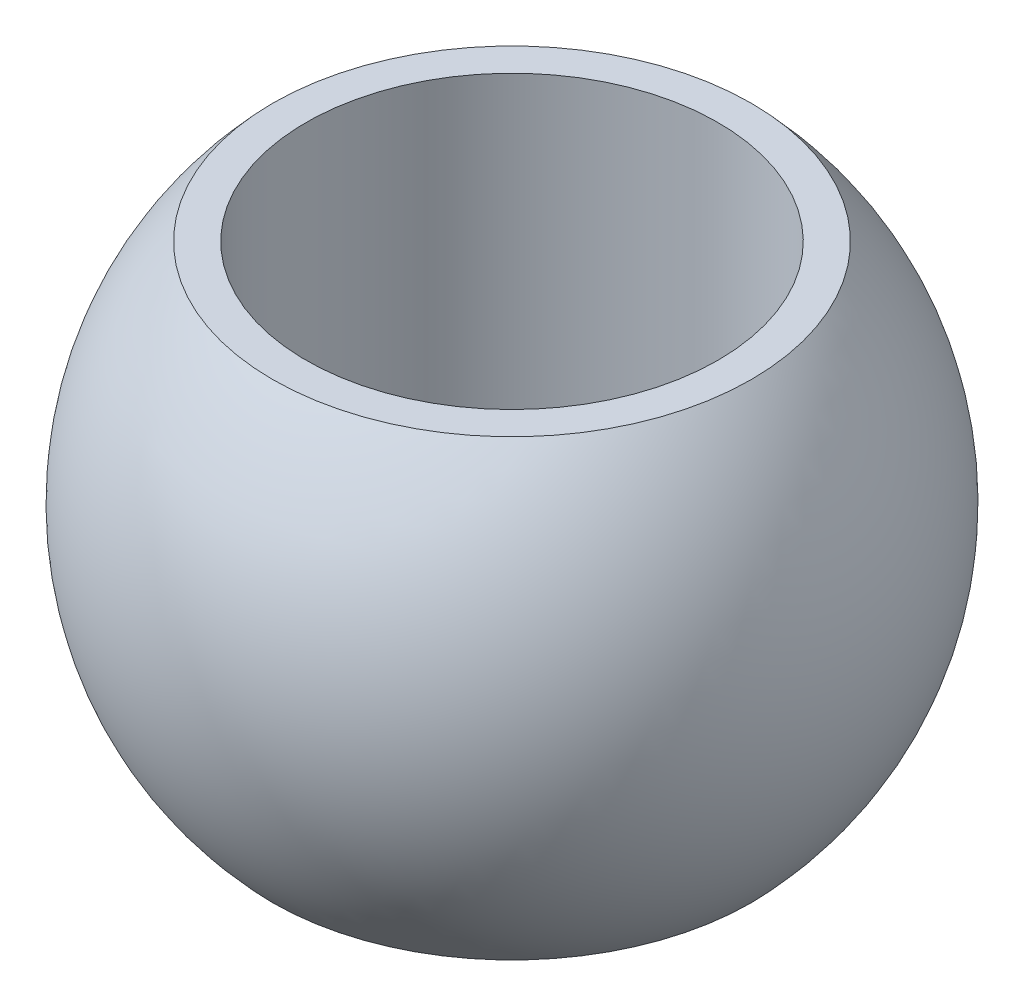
ISO-10303-21;
HEADER;
FILE_DESCRIPTION(('STEP AP214'),'2;1');
FILE_NAME('part.step','',(''),(''),'','','');
FILE_SCHEMA(('AUTOMOTIVE_DESIGN { 1 0 10303 214 1 1 1 1 }'));
ENDSEC;
DATA;
#1=APPLICATION_CONTEXT('core data for automotive mechanical design processes');
#2=APPLICATION_PROTOCOL_DEFINITION('international standard','automotive_design',2000,#1);
#3=PRODUCT_CONTEXT('',#1,'mechanical');
#4=PRODUCT('Part','Part','',(#3));
#5=PRODUCT_RELATED_PRODUCT_CATEGORY('part','',(#4));
#6=PRODUCT_DEFINITION_FORMATION('','',#4);
#7=PRODUCT_DEFINITION_CONTEXT('part definition',#1,'design');
#8=PRODUCT_DEFINITION('design','',#6,#7);
#9=PRODUCT_DEFINITION_SHAPE('','',#8);
#10=(LENGTH_UNIT() NAMED_UNIT(*) SI_UNIT(.MILLI.,.METRE.));
#11=(NAMED_UNIT(*) PLANE_ANGLE_UNIT() SI_UNIT($,.RADIAN.));
#12=(NAMED_UNIT(*) SI_UNIT($,.STERADIAN.) SOLID_ANGLE_UNIT());
#13=UNCERTAINTY_MEASURE_WITH_UNIT(LENGTH_MEASURE(1.E-05),#10,'distance_accuracy_value','');
#14=(GEOMETRIC_REPRESENTATION_CONTEXT(3) GLOBAL_UNCERTAINTY_ASSIGNED_CONTEXT((#13)) GLOBAL_UNIT_ASSIGNED_CONTEXT((#10,
#11,#12)) REPRESENTATION_CONTEXT('',''));
#15=CARTESIAN_POINT('',(0.,0.,0.));
#16=DIRECTION('',(0.,0.,1.));
#17=DIRECTION('',(1.,0.,0.));
#18=AXIS2_PLACEMENT_3D('',#15,#16,#17);
#19=CARTESIAN_POINT('',(-25.,27.5,0.));
#20=DIRECTION('',(0.,-1.,0.));
#21=DIRECTION('',(1.,0.,0.));
#22=AXIS2_PLACEMENT_3D('',#19,#20,#21);
#23=PLANE('',#22);
#24=CARTESIAN_POINT('',(0.,27.5,0.));
#25=DIRECTION('',(0.,-1.,0.));
#26=DIRECTION('',(1.,0.,0.));
#27=AXIS2_PLACEMENT_3D('',#24,#25,#26);
#28=CIRCLE('',#27,29.0473750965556);
#29=CARTESIAN_POINT('',(-29.0473750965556,27.5,0.));
#30=VERTEX_POINT('',#29);
#31=EDGE_CURVE('E10',#30,#30,#28,.T.);
#32=ORIENTED_EDGE('',*,*,#31,.F.);
#33=EDGE_LOOP('',(#32));
#34=FACE_BOUND('',#33,.T.);
#35=CARTESIAN_POINT('',(0.,27.5,0.));
#36=DIRECTION('',(0.,-1.,0.));
#37=DIRECTION('',(1.,0.,0.));
#38=AXIS2_PLACEMENT_3D('',#35,#36,#37);
#39=CIRCLE('',#38,25.);
#40=CARTESIAN_POINT('',(25.,27.5,0.));
#41=VERTEX_POINT('',#40);
#42=EDGE_CURVE('E49',#41,#41,#39,.T.);
#43=ORIENTED_EDGE('',*,*,#42,.T.);
#44=EDGE_LOOP('',(#43));
#45=FACE_BOUND('',#44,.T.);
#46=ADVANCED_FACE('F35',(#34,#45),#23,.F.);
#47=CARTESIAN_POINT('',(0.,0.,0.));
#48=DIRECTION('',(0.,-1.,0.));
#49=DIRECTION('',(-1.,0.,0.));
#50=AXIS2_PLACEMENT_3D('',#47,#48,#49);
#51=SPHERICAL_SURFACE('',#50,40.);
#52=CARTESIAN_POINT('',(0.,-27.5,0.));
#53=DIRECTION('',(0.,-1.,0.));
#54=DIRECTION('',(1.,0.,0.));
#55=AXIS2_PLACEMENT_3D('',#52,#53,#54);
#56=CIRCLE('',#55,29.0473750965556);
#57=CARTESIAN_POINT('',(-29.0473750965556,-27.5,0.));
#58=VERTEX_POINT('',#57);
#59=EDGE_CURVE('E41',#58,#58,#56,.T.);
#60=CARTESIAN_POINT('',(-29.0473750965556,-27.5,0.));
#61=CARTESIAN_POINT('',(-29.4816784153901,-27.0412767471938,0.));
#62=CARTESIAN_POINT('',(-29.9050970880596,-26.5722500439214,0.));
#63=CARTESIAN_POINT('',(-30.7292550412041,-25.6146768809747,0.));
#64=CARTESIAN_POINT('',(-31.1299943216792,-25.1261304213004,0.));
#65=CARTESIAN_POINT('',(-31.9078833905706,-24.1306048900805,0.));
#66=CARTESIAN_POINT('',(-32.2850331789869,-23.6236258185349,0.));
#67=CARTESIAN_POINT('',(-33.0148997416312,-22.5923753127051,0.));
#68=CARTESIAN_POINT('',(-33.3676165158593,-22.068103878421,0.));
#69=CARTESIAN_POINT('',(-34.0478247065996,-21.0034445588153,0.));
#70=CARTESIAN_POINT('',(-34.3753161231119,-20.4630566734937,0.));
#71=CARTESIAN_POINT('',(-35.0043388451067,-19.3673773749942,0.));
#72=CARTESIAN_POINT('',(-35.3058701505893,-18.8120859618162,0.));
#73=CARTESIAN_POINT('',(-35.8822958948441,-17.6878457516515,0.));
#74=CARTESIAN_POINT('',(-36.1571903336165,-17.1188969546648,0.));
#75=CARTESIAN_POINT('',(-36.6797254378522,-15.9686188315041,0.));
#76=CARTESIAN_POINT('',(-36.9273661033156,-15.3872895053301,0.));
#77=CARTESIAN_POINT('',(-37.3948378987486,-14.2135549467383,0.));
#78=CARTESIAN_POINT('',(-37.6146690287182,-13.6211497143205,0.));
#79=CARTESIAN_POINT('',(-38.0260284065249,-12.4265928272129,0.));
#80=CARTESIAN_POINT('',(-38.2175566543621,-11.8244411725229,0.));
#81=CARTESIAN_POINT('',(-38.5718804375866,-10.6117427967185,0.));
#82=CARTESIAN_POINT('',(-38.734675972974,-10.0011960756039,0.));
#83=CARTESIAN_POINT('',(-39.0311689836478,-8.77307776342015,0.));
#84=CARTESIAN_POINT('',(-39.1648664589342,-8.15550617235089,0.));
#85=CARTESIAN_POINT('',(-39.4028633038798,-6.91472408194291,0.));
#86=CARTESIAN_POINT('',(-39.5071626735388,-6.29151358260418,0.));
#87=CARTESIAN_POINT('',(-39.6861292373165,-5.04085229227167,0.));
#88=CARTESIAN_POINT('',(-39.7607964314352,-4.41340150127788,0.));
#89=CARTESIAN_POINT('',(-39.8803310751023,-3.15566776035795,0.));
#90=CARTESIAN_POINT('',(-39.9251985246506,-2.52538481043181,0.));
#91=CARTESIAN_POINT('',(-39.9850329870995,-1.26340124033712,0.));
#92=CARTESIAN_POINT('',(-40.,-0.631700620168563,0.));
#93=CARTESIAN_POINT('',(-40.,0.63170062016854,0.));
#94=CARTESIAN_POINT('',(-39.9850329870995,1.26340124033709,0.));
#95=CARTESIAN_POINT('',(-39.9251985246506,2.52538481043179,0.));
#96=CARTESIAN_POINT('',(-39.8803310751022,3.15566776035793,0.));
#97=CARTESIAN_POINT('',(-39.7607964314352,4.41340150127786,0.));
#98=CARTESIAN_POINT('',(-39.6861292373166,5.04085229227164,0.));
#99=CARTESIAN_POINT('',(-39.5071626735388,6.29151358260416,0.));
#100=CARTESIAN_POINT('',(-39.4028633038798,6.91472408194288,0.));
#101=CARTESIAN_POINT('',(-39.1648664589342,8.15550617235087,0.));
#102=CARTESIAN_POINT('',(-39.0311689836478,8.77307776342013,0.));
#103=CARTESIAN_POINT('',(-38.734675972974,10.0011960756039,0.));
#104=CARTESIAN_POINT('',(-38.5718804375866,10.6117427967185,0.));
#105=CARTESIAN_POINT('',(-38.2175566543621,11.8244411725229,0.));
#106=CARTESIAN_POINT('',(-38.0260284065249,12.4265928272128,0.));
#107=CARTESIAN_POINT('',(-37.6146690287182,13.6211497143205,0.));
#108=CARTESIAN_POINT('',(-37.3948378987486,14.2135549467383,0.));
#109=CARTESIAN_POINT('',(-36.9273661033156,15.3872895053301,0.));
#110=CARTESIAN_POINT('',(-36.6797254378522,15.9686188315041,0.));
#111=CARTESIAN_POINT('',(-36.1571903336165,17.1188969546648,0.));
#112=CARTESIAN_POINT('',(-35.8822958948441,17.6878457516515,0.));
#113=CARTESIAN_POINT('',(-35.3058701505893,18.8120859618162,0.));
#114=CARTESIAN_POINT('',(-35.0043388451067,19.3673773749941,0.));
#115=CARTESIAN_POINT('',(-34.3753161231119,20.4630566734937,0.));
#116=CARTESIAN_POINT('',(-34.0478247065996,21.0034445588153,0.));
#117=CARTESIAN_POINT('',(-33.3676165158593,22.068103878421,0.));
#118=CARTESIAN_POINT('',(-33.0148997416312,22.5923753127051,0.));
#119=CARTESIAN_POINT('',(-32.2850331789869,23.6236258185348,0.));
#120=CARTESIAN_POINT('',(-31.9078833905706,24.1306048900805,0.));
#121=CARTESIAN_POINT('',(-31.1299943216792,25.1261304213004,0.));
#122=CARTESIAN_POINT('',(-30.7292550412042,25.6146768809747,0.));
#123=CARTESIAN_POINT('',(-29.9050970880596,26.5722500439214,0.));
#124=CARTESIAN_POINT('',(-29.4816784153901,27.0412767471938,0.));
#125=CARTESIAN_POINT('',(-29.0473750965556,27.5,0.));
#126=B_SPLINE_CURVE_WITH_KNOTS('',3,(#60,#61,#62,#63,#64,#65,#66,#67,#68,#69,#70,#71,#72,#73,
#74,#75,#76,#77,#78,#79,#80,#81,#82,#83,#84,#85,#86,#87,#88,#89,#90,#91,#92,#93,#94,#95,#96,#97,
#98,#99,#100,#101,#102,#103,#104,#105,#106,#107,#108,#109,#110,#111,#112,#113,#114,#115,#116,
#117,#118,#119,#120,#121,#122,#123,#124,#125),.UNSPECIFIED.,.F.,.F.,(4,2,2,2,2,2,2,2,2,2,2,2,2,
2,2,2,2,2,2,2,2,2,2,2,2,2,2,2,2,2,2,2,4),(0.,1.89492467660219,3.78984935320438,5.68477402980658,
7.57969870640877,9.47462338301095,11.3695480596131,13.2644727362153,15.1593974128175,
17.0543220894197,18.9492467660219,20.8441714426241,22.7390961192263,24.6340207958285,
26.5289454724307,28.4238701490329,30.3187948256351,32.2137195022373,34.1086441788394,
36.0035688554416,37.8984935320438,39.793418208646,41.6883428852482,43.5832675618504,
45.4781922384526,47.3731169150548,49.268041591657,51.1629662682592,53.0578909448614,
54.9528156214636,56.8477402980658,58.742664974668,60.6375896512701),.UNSPECIFIED.);
#127=EDGE_CURVE('BSEAM64',#58,#30,#126,.T.);
#128=ORIENTED_EDGE('',*,*,#59,.F.);
#129=ORIENTED_EDGE('',*,*,#31,.T.);
#130=ORIENTED_EDGE('',*,*,#127,.T.);
#131=ORIENTED_EDGE('',*,*,#127,.F.);
#132=EDGE_LOOP('',(#128,#130,#129,#131));
#133=FACE_BOUND('',#132,.T.);
#134=ADVANCED_FACE('F64',(#133),#51,.T.);
#135=CARTESIAN_POINT('',(-25.,-27.5,0.));
#136=DIRECTION('',(0.,1.,0.));
#137=DIRECTION('',(-1.,0.,0.));
#138=AXIS2_PLACEMENT_3D('',#135,#136,#137);
#139=PLANE('',#138);
#140=CARTESIAN_POINT('',(0.,-27.5,0.));
#141=DIRECTION('',(0.,-1.,0.));
#142=DIRECTION('',(1.,0.,0.));
#143=AXIS2_PLACEMENT_3D('',#140,#141,#142);
#144=CIRCLE('',#143,25.);
#145=CARTESIAN_POINT('',(25.,-27.5,0.));
#146=VERTEX_POINT('',#145);
#147=EDGE_CURVE('E45',#146,#146,#144,.T.);
#148=ORIENTED_EDGE('',*,*,#147,.F.);
#149=EDGE_LOOP('',(#148));
#150=FACE_BOUND('',#149,.T.);
#151=ORIENTED_EDGE('',*,*,#59,.T.);
#152=EDGE_LOOP('',(#151));
#153=FACE_BOUND('',#152,.T.);
#154=ADVANCED_FACE('F59',(#150,#153),#139,.F.);
#155=CARTESIAN_POINT('',(0.,-27.5,0.));
#156=DIRECTION('',(0.,-1.,0.));
#157=DIRECTION('',(1.,0.,0.));
#158=AXIS2_PLACEMENT_3D('',#155,#156,#157);
#159=CYLINDRICAL_SURFACE('',#158,25.);
#160=ORIENTED_EDGE('',*,*,#42,.F.);
#161=EDGE_LOOP('',(#160));
#162=FACE_BOUND('',#161,.T.);
#163=ORIENTED_EDGE('',*,*,#147,.T.);
#164=EDGE_LOOP('',(#163));
#165=FACE_BOUND('',#164,.T.);
#166=ADVANCED_FACE('F56',(#162,#165),#159,.F.);
#167=CLOSED_SHELL('',(#46,#134,#154,#166));
#168=MANIFOLD_SOLID_BREP('B2',#167);
#169=ADVANCED_BREP_SHAPE_REPRESENTATION('',(#18,#168),#14);
#170=SHAPE_DEFINITION_REPRESENTATION(#9,#169);
ENDSEC;
END-ISO-10303-21;
